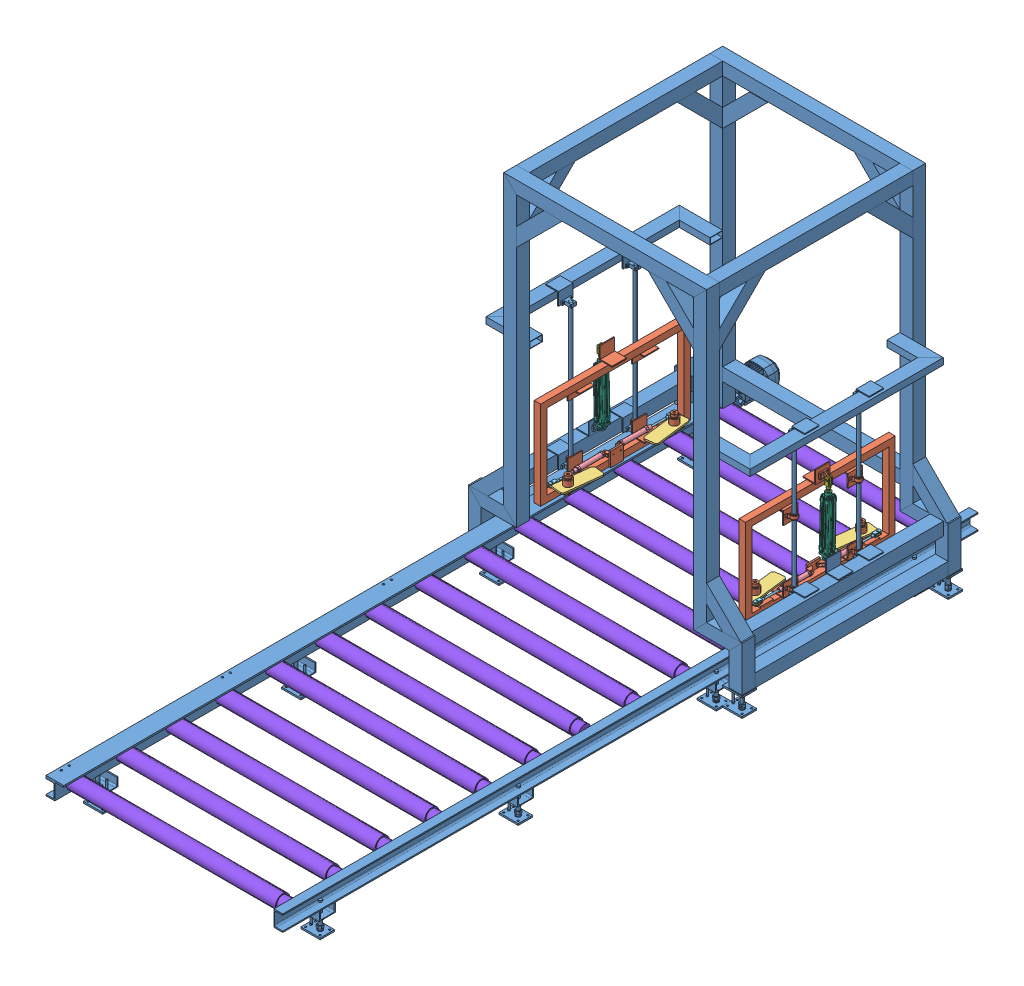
SolidWorks assembly unstackerv2.SLDASM, configuration Défaut (file format 7000). Lengths in mm.
Overall size (1762 2191 4544.5).
33 component instances, 8 part files, 70 mates.
Components (placement in the parent):
- ensemble-fixe-1: ensemble-fixe.SLDPRT [Défaut] at origin size (1762 2191 4544.5)
- systeme support de doigt-1: systeme support de doigt.SLDPRT [Défaut] at (-615.8 538.0756 308.5297) x (0 0 1) z (-1 0 0) size (930 630 168)
- CHA_7-Doigt-1: CHA_7-Doigt.SLDPRT [Défaut] at (-653.1156 597.1756 386.7807) x (0.119743 0 0.992805) z (0 1 0) size (240 105 10)
- CHA_7-Corp verin D25-1: CHA_7-Corp verin D25.sldprt [Défaut] at (-638.4662 602.1756 553.6131) x (-0.01326 0 0.999912) z (0 -1 0) size (207 27 27)
- ensemble tige verin D25-1: ensemble tige verin D25.SLDPRT [Défaut] at (-632.4635 595.1107 724.7077) x (-0.867076 0.498043 -0.011499) z (0.01326 0 -0.999912) size (27.3 29.26 240.78)
- CHA_7-Corp verin D25-2: CHA_7-Corp verin D25.sldprt [Défaut] at (-638.4662 602.1756 993.4463) x (-0.01326 0 -0.999912) z (0 -1 0) size (207 27 27)
- CHA_7-Doigt-2: CHA_7-Doigt.SLDPRT [Défaut] at (-653.1156 607.1756 1160.2788) x (0.119743 0 -0.992805) z (0 -1 0) size (240 105 10)
- ensemble tige verin D25-2: ensemble tige verin D25.SLDPRT [Défaut] at (-649.0039 595.1107 822.5711) x (0.867076 0.498043 -0.011499) z (0.01326 0 0.999912) size (27.3 29.26 240.78)
- systeme support de doigt-2: systeme support de doigt.SLDPRT [Défaut] at (615.8 538.0756 1238.2229) x (0 0 -1) z (1 0 0) size (930 630 168)
- CHA_7-Corp verin D25-3: CHA_7-Corp verin D25.sldprt [Défaut] at (638.4662 602.1756 553.3062) x (0.01326 0 0.999912) z (0 -1 0) size (207 27 27)
- CHA_7-Doigt-3: CHA_7-Doigt.SLDPRT [Défaut] at (653.1156 607.1756 386.4738) x (-0.119743 0 0.992805) z (0 -1 0) size (240 105 10)
- ensemble tige verin D25-3: ensemble tige verin D25.SLDPRT [Défaut] at (649.0039 595.1107 724.1815) x (-0.867076 0.498043 0.011499) z (-0.01326 0 -0.999912) size (27.3 29.26 240.78)
- CHA_7-Corp verin D25-4: CHA_7-Corp verin D25.sldprt [Défaut] at (638.4662 602.1756 993.1395) x (0.01326 0 -0.999912) z (0 -1 0) size (207 27 27)
- CHA_7-Doigt-4: CHA_7-Doigt.SLDPRT [Défaut] at (653.1156 597.1756 1159.9719) x (-0.119743 0 -0.992805) z (0 1 0) size (240 105 10)
- ensemble tige verin D25-4: ensemble tige verin D25.SLDPRT [Défaut] at (632.4635 595.1107 822.0448) x (0.867076 0.498043 0.011499) z (-0.01326 0 0.999912) size (27.3 29.26 240.78)
- corp verin D40-1: corp verin D40.SLDPRT [Défaut] at (-750.0686 879.3027 1100.6768) x (0 0 1) z (-0.023417 0.999726 0) size (53 53 367.5)
- tige Verin D40-2: tige Verin D40.SLDPRT [Défaut] at (-690.863 677.3225 775.2118) x (0 0 -1) z (-0.023417 0.999726 0) size (40 40 370)
- corp verin D40-2: corp verin D40.SLDPRT [Défaut] at (750.0686 879.3027 446.0826) x (0 0 -1) z (0.023417 0.999726 0) size (53 53 367.5)
- tige Verin D40-3: tige Verin D40.SLDPRT [Défaut] at (690.863 677.3225 771.5476) x (0 0 1) z (0.023417 0.999726 0) size (40 40 370)
- CHA_7rouleau commande-2: CHA_7rouleau commande.SLDPRT [Défaut] at (-672.5 448.1904 58.3797) x (1 0 0) z (0 -0.985836 0.16771) size (1360 89 89)
- CHA_7rouleau commande-3: CHA_7rouleau commande.SLDPRT [Défaut] at (-680 448.1904 367.3797) x (1 0 0) z (0 0.898544 -0.438884) size (1360 89 89)
- CHA_7rouleau commande-4: CHA_7rouleau commande.SLDPRT [Défaut] at (-680 448.1904 676.3797) x (1 0 0) z (0 0.88032 -0.47438) size (1360 89 89)
- CHA_7rouleau commande-5: CHA_7rouleau commande.SLDPRT [Défaut] at (-680 448.1904 985.3797) x (1 0 0) z (0 0.819392 -0.573233) size (1360 89 89)
- CHA_7rouleau commande-7: CHA_7rouleau commande.SLDPRT [Défaut] at (-680 448.1904 1603.3797) x (1 0 0) z (0 0.986009 -0.166691) size (1360 89 89)
- CHA_7rouleau commande-8: CHA_7rouleau commande.SLDPRT [Défaut] at (-680 448.1904 1912.3797) x (1 0 0) z (0 0.956459 -0.291868) size (1360 89 89)
- CHA_7rouleau commande-9: CHA_7rouleau commande.SLDPRT [Défaut] at (-711.5119 448.1904 2221.3797) x (1 0 0) z (0 0.631126 0.775681) size (1360 89 89)
- CHA_7rouleau commande-10: CHA_7rouleau commande.SLDPRT [Défaut] at (-680 448.1904 2530.3797) x (1 0 0) z (0 0.656428 -0.754388) size (1360 89 89)
- CHA_7rouleau commande-11: CHA_7rouleau commande.SLDPRT [Défaut] at (-680 448.1904 2839.3797) x (1 0 0) z (0 0.698585 -0.715527) size (1360 89 89)
- CHA_7rouleau commande-12: CHA_7rouleau commande.SLDPRT [Défaut] at (-680 448.1904 3148.3797) x (1 0 0) z (0 0.828178 -0.560465) size (1360 89 89)
- CHA_7rouleau commande-13: CHA_7rouleau commande.SLDPRT [Défaut] at (-680 448.1904 3457.3797) x (1 0 0) z (0 0.997224 -0.074457) size (1360 89 89)
- CHA_7rouleau commande-14: CHA_7rouleau commande.SLDPRT [Défaut] at (-680 448.1904 3766.3797) x (1 0 0) z (0 0.577241 -0.816574) size (1360 89 89)
- CHA_7rouleau commande-15: CHA_7rouleau commande.SLDPRT [Défaut] at (-680 448.1904 4075.3797) x (1 0 0) z (0 0.981161 0.193194) size (1360 89 89)
- CHA_7rouleau commande-16: CHA_7rouleau commande.SLDPRT [Défaut] at (-680 448.1904 1294.3797) x (1 0 0) z (0 0.969586 0.244749) size (1360 89 89)
Mates (geometry in assembly coordinates):
- Coaxiale4: concentric anti-aligned: cylinder of ensemble-fixe-1 through (-694 1469.6904 573.3797) axis (0 -1 0) radius 10; cylinder of systeme support de doigt-1 through (-694 995.3756 573.3797) axis (0 1 0) radius 10
- Coaxiale5: concentric anti-aligned: cylinder of ensemble-fixe-1 through (-694 1469.6904 973.3797) axis (0 -1 0) radius 10; cylinder of systeme support de doigt-1 through (-694 995.3756 973.3797) axis (0 1 0) radius 10
- Coaxiale7: concentric aligned: cylinder of systeme support de doigt-1 through (-580.8 642.1756 443.5297) axis (0 -1 0) radius 25; cylinder of CHA_7-Doigt-1 through (-580.8 607.1756 443.5297) axis (0 -1 0) radius 25
- Distance4: distance = 35 mm aligned: plane of CHA_7-Doigt-1 through (-649.5233 607.1756 416.5648) normal (0 1 0); plane of systeme support de doigt-1 through (-580.8 642.1756 443.5297) normal (0 1 0)
- Coaxiale8: concentric anti-aligned: cylinder of systeme support de doigt-1 through (-640.8 593.3256 729.5976) axis (0 1 0) radius 4; cylinder of CHA_7-Corp verin D25-1 through (-640.8 610.1256 729.5976) axis (0 -1 0) radius 4
- Coaxiale9: concentric aligned: cylinder of CHA_7-Doigt-1 through (-636.4274 607.1756 399.8766) axis (0 -1 0) radius 5.5; cylinder of ensemble tige verin D25-1 through (-636.4274 607.1756 399.8766) axis (0 -1 0) radius 5
- Coïncidente5: coincident anti-aligned: plane of CHA_7-Doigt-1 through (-649.5233 607.1756 416.5648) normal (0 1 0); plane of ensemble tige verin D25-1 through (-646.1843 607.1756 381.484) normal (0 -1 0)
- Coaxiale10: concentric aligned: cylinder of CHA_7-Corp verin D25-1 through (-638.6651 602.1756 568.6118) axis (-0.01326 0 0.999912) radius 13.25; cylinder of ensemble tige verin D25-1 through (-638.864 602.1756 583.6104) axis (-0.01326 0 0.999912) radius 12.5
- DistanceLimite1: limit distance = 95 mm aligned: plane of ensemble tige verin D25-1 through (-656.6493 597.5064 622.378) normal (-0.01326 0 0.999912); plane of CHA_7-Corp verin D25-1 through (-628.3701 615.6756 717.7614) normal (-0.01326 0 0.999912)
- Coaxiale11: concentric aligned: cylinder of systeme support de doigt-1 through (-640.8 609.8256 817.4618) axis (0 -1 0) radius 4; cylinder of CHA_7-Corp verin D25-2 through (-640.8 610.1256 817.4618) axis (0 -1 0) radius 4
- Coaxiale12: concentric anti-aligned: cylinder of systeme support de doigt-1 through (-580.8 642.1756 1103.5297) axis (0 -1 0) radius 25; cylinder of CHA_7-Doigt-2 through (-580.8 597.1756 1103.5297) axis (0 1 0) radius 25
- Distance6: distance = 35 mm aligned: plane of CHA_7-Doigt-2 through (-649.5233 607.1756 1130.4946) normal (0 1 0); plane of systeme support de doigt-1 through (-580.8 642.1756 1103.5297) normal (0 1 0)
- Coaxiale13: concentric anti-aligned: cylinder of CHA_7-Doigt-2 through (-636.4274 597.1756 1147.1828) axis (0 1 0) radius 5.5; cylinder of ensemble tige verin D25-2 through (-636.4274 607.1756 1147.1828) axis (0 -1 0) radius 5
- Coïncidente10: coincident anti-aligned: plane of CHA_7-Doigt-2 through (-649.5233 607.1756 1130.4946) normal (0 1 0); plane of ensemble tige verin D25-2 through (-626.1861 607.1756 1165.3102) normal (0 -1 0)
- Coaxiale14: concentric aligned: cylinder of CHA_7-Corp verin D25-2 through (-638.6651 602.1756 978.4477) axis (-0.01326 0 -0.999912) radius 13.25; cylinder of ensemble tige verin D25-2 through (-638.864 602.1756 963.449) axis (-0.01326 0 -0.999912) radius 12.5
- DistanceLimite2: limit distance = 95 mm aligned: plane of ensemble tige verin D25-2 through (-622.1129 597.5064 924.2234) normal (-0.01326 0 -0.999912); plane of CHA_7-Corp verin D25-2 through (-652.9116 615.6756 829.6235) normal (-0.01326 0 -0.999912)
- Coaxiale15: concentric anti-aligned: cylinder of ensemble-fixe-1 through (694 1469.6904 973.3729) axis (0 -1 0) radius 10; cylinder of systeme support de doigt-2 through (694 995.3756 973.3729) axis (0 1 0) radius 10
- Coaxiale16: concentric anti-aligned: cylinder of ensemble-fixe-1 through (694 1469.6904 573.3729) axis (0 -1 0) radius 10; cylinder of systeme support de doigt-2 through (694 995.3756 573.3729) axis (0 1 0) radius 10
- Coaxiale17: concentric anti-aligned: cylinder of systeme support de doigt-2 through (580.8 642.1756 443.2229) axis (0 -1 0) radius 25; cylinder of CHA_7-Doigt-3 through (580.8 597.1756 443.2229) axis (0 1 0) radius 25
- Distance8: distance = 35 mm aligned: plane of CHA_7-Doigt-3 through (649.5233 607.1756 416.258) normal (0 1 0); plane of systeme support de doigt-2 through (580.8 642.1756 443.2229) normal (0 1 0)
- Coaxiale18: concentric aligned: cylinder of systeme support de doigt-2 through (640.8 609.8256 729.2907) axis (0 -1 0) radius 4; cylinder of CHA_7-Corp verin D25-3 through (640.8 610.1256 729.2907) axis (0 -1 0) radius 4
- Coaxiale19: concentric anti-aligned: cylinder of CHA_7-Doigt-3 through (636.4274 597.1756 399.5697) axis (0 1 0) radius 5.5; cylinder of ensemble tige verin D25-3 through (636.4274 607.1756 399.5697) axis (0 -1 0) radius 5
- Coaxiale20: concentric aligned: cylinder of CHA_7-Corp verin D25-3 through (638.6651 602.1756 568.3049) axis (0.01326 0 0.999912) radius 13.25; cylinder of ensemble tige verin D25-3 through (638.864 602.1756 583.3036) axis (0.01326 0 0.999912) radius 12.5
- DistanceLimite3: limit distance = 95 mm aligned: plane of ensemble tige verin D25-3 through (622.1129 597.5064 622.5292) normal (0.01326 0 0.999912); plane of CHA_7-Corp verin D25-3 through (652.9116 615.6756 717.1291) normal (0.01326 0 0.999912)
- Coïncidente14: coincident anti-aligned: plane of CHA_7-Doigt-3 through (649.5233 607.1756 416.258) normal (0 1 0); plane of ensemble tige verin D25-3 through (626.1861 607.1756 381.4424) normal (0 -1 0)
- Coaxiale21: concentric aligned: cylinder of systeme support de doigt-2 through (580.8 642.1756 1103.2229) axis (0 -1 0) radius 25; cylinder of CHA_7-Doigt-4 through (580.8 607.1756 1103.2229) axis (0 -1 0) radius 25
- Coaxiale22: concentric anti-aligned: cylinder of systeme support de doigt-2 through (640.8 593.3256 817.155) axis (0 1 0) radius 4; cylinder of CHA_7-Corp verin D25-4 through (640.8 610.1256 817.155) axis (0 -1 0) radius 4
- Distance10: distance = 35 mm aligned: plane of CHA_7-Doigt-4 through (649.5233 607.1756 1130.1878) normal (0 1 0); plane of systeme support de doigt-2 through (580.8 642.1756 1103.2229) normal (0 1 0)
- Coaxiale23: concentric aligned: cylinder of CHA_7-Doigt-4 through (636.4274 607.1756 1146.876) axis (0 -1 0) radius 5.5; cylinder of ensemble tige verin D25-4 through (636.4274 607.1756 1146.876) axis (0 -1 0) radius 5
- Coaxiale24: concentric aligned: cylinder of CHA_7-Corp verin D25-4 through (638.6651 602.1756 978.1408) axis (0.01326 0 -0.999912) radius 13.25; cylinder of ensemble tige verin D25-4 through (638.864 602.1756 963.1421) axis (0.01326 0 -0.999912) radius 12.5
- Coïncidente17: coincident anti-aligned: plane of CHA_7-Doigt-4 through (649.5233 607.1756 1130.1878) normal (0 1 0); plane of ensemble tige verin D25-4 through (646.1843 607.1756 1165.2685) normal (0 -1 0)
- DistanceLimite4: limit distance = 95 mm aligned: plane of ensemble tige verin D25-4 through (656.6493 597.5064 924.3746) normal (0.01326 0 -0.999912); plane of CHA_7-Corp verin D25-4 through (628.3701 615.6756 828.9912) normal (0.01326 0 -0.999912)
- Coaxiale25: concentric anti-aligned: cylinder of ensemble-fixe-1 through (-698 694.1904 746.3797) axis (0 0 1) radius 6; cylinder of corp verin D40-1 through (-698 694.1904 795.8797) axis (0 0 -1) radius 6
- Coïncidente18: coincident anti-aligned: plane of ensemble-fixe-1 through (-680 663.6903 765.3797) normal (0 0 -1); plane of corp verin D40-1 through (-698 694.1904 765.3797) normal (0 0 1)
- Coaxiale26: concentric anti-aligned: cylinder of systeme support de doigt-1 through (-707.8 1112.5756 778.0297) axis (0 0 -1) radius 6; cylinder of tige Verin D40-2 through (-707.8 1112.5756 757.3797) axis (0 0 1) radius 6
- Coaxiale29: concentric anti-aligned: cone of corp verin D40-1 through (-705.9501 1033.5973 773.3797) axis (-0.023417 0.999726 0); cylinder of tige Verin D40-2 through (-698.853 730.6071 773.3797) axis (0.023417 -0.999726 0) radius 20
- DistanceLimite5: limit distance = 10 mm aligned: plane of tige Verin D40-2 through (-699.5806 761.6719 773.3797) normal (0.023417 -0.999726 0); plane of corp verin D40-1 through (-718.3413 751.2297 768.0547) normal (0.023417 -0.999726 0)
- Coaxiale30: concentric anti-aligned: cylinder of ensemble-fixe-1 through (698 694.1904 800.3797) axis (0 0 -1) radius 6; cylinder of corp verin D40-2 through (698 694.1904 750.8797) axis (0 0 1) radius 6
- Coïncidente19: coincident anti-aligned: plane of ensemble-fixe-1 through (680 663.6903 781.3797) normal (0 0 1); plane of corp verin D40-2 through (698 694.1904 781.3797) normal (0 0 -1)
- Coaxiale31: concentric anti-aligned: cylinder of systeme support de doigt-2 through (707.8 1112.5756 768.7229) axis (0 0 1) radius 6; cylinder of tige Verin D40-3 through (707.8 1112.5756 789.3797) axis (0 0 -1) radius 6
- Coaxiale33: concentric anti-aligned: cone of corp verin D40-2 through (705.9501 1033.5973 773.3797) axis (0.023417 0.999726 0); cylinder of tige Verin D40-3 through (698.853 730.6071 773.3797) axis (-0.023417 -0.999726 0) radius 20
- DistanceLimite6: limit distance = 10 mm aligned: plane of tige Verin D40-3 through (699.5806 761.6719 773.3797) normal (-0.023417 -0.999726 0); plane of corp verin D40-2 through (718.3413 751.2297 778.7047) normal (-0.023417 -0.999726 0)
- Coaxiale35: concentric aligned: circle of ensemble-fixe-1; cylinder of CHA_7rouleau commande-2 through (654.5 448.1904 58.3797) axis (1 0 0) radius 6
- Coïncidente22: coincident anti-aligned: plane of ensemble-fixe-1 through (680 398.1904 -126.6203) normal (-1 0 0); plane of CHA_7rouleau commande-2 through (680 448.1904 58.3797) normal (1 0 0)
- Coïncidente23: coincident anti-aligned: plane of ensemble-fixe-1 through (-680 398.1904 4190.3797) normal (1 0 0); plane of CHA_7rouleau commande-3 through (-680 448.1904 367.3797) normal (-1 0 0)
- Coaxiale36: concentric aligned: cylinder of ensemble-fixe-1 through (-680 448.1904 367.3797) axis (-1 0 0) radius 7.5; cylinder of CHA_7rouleau commande-3 through (-653 448.1904 367.3797) axis (-1 0 0) radius 5
- Coïncidente24: coincident anti-aligned: plane of ensemble-fixe-1 through (-680 398.1904 4190.3797) normal (1 0 0); plane of CHA_7rouleau commande-5 through (-680 448.1904 985.3797) normal (-1 0 0)
- Coïncidente26: coincident anti-aligned: plane of ensemble-fixe-1 through (-680 398.1904 4190.3797) normal (1 0 0); plane of CHA_7rouleau commande-7 through (-680 448.1904 1603.3797) normal (-1 0 0)
- Coïncidente27: coincident anti-aligned: plane of ensemble-fixe-1 through (-680 398.1904 4190.3797) normal (1 0 0); plane of CHA_7rouleau commande-8 through (-680 448.1904 1912.3797) normal (-1 0 0)
- Coïncidente28: coincident anti-aligned: plane of ensemble-fixe-1 through (-680 398.1904 4190.3797) normal (1 0 0); plane of CHA_7rouleau commande-10 through (-680 448.1904 2530.3797) normal (-1 0 0)
- Coïncidente29: coincident anti-aligned: plane of ensemble-fixe-1 through (-680 398.1904 4190.3797) normal (1 0 0); plane of CHA_7rouleau commande-11 through (-680 448.1904 2839.3797) normal (-1 0 0)
- Coïncidente30: coincident anti-aligned: plane of ensemble-fixe-1 through (-680 398.1904 4190.3797) normal (1 0 0); plane of CHA_7rouleau commande-12 through (-680 448.1904 3148.3797) normal (-1 0 0)
- Coïncidente31: coincident anti-aligned: plane of ensemble-fixe-1 through (-680 398.1904 4190.3797) normal (1 0 0); plane of CHA_7rouleau commande-13 through (-680 448.1904 3457.3797) normal (-1 0 0)
- Coïncidente32: coincident anti-aligned: plane of ensemble-fixe-1 through (-680 398.1904 4190.3797) normal (1 0 0); plane of CHA_7rouleau commande-14 through (-680 448.1904 3766.3797) normal (-1 0 0)
- Coïncidente33: coincident anti-aligned: plane of ensemble-fixe-1 through (-680 398.1904 4190.3797) normal (1 0 0); plane of CHA_7rouleau commande-15 through (-680 448.1904 4075.3797) normal (-1 0 0)
- Coaxiale37: concentric aligned: cylinder of ensemble-fixe-1 through (-680 448.1904 985.3797) axis (-1 0 0) radius 7.5; cylinder of CHA_7rouleau commande-5 through (-653 448.1904 985.3797) axis (-1 0 0) radius 5
- Coaxiale38: concentric aligned: circle of ensemble-fixe-1; cylinder of CHA_7rouleau commande-16 through (-653 448.1904 1294.3797) axis (-1 0 0) radius 5
- Coïncidente35: coincident anti-aligned: plane of ensemble-fixe-1 through (-680 398.1904 4190.3797) normal (1 0 0); plane of CHA_7rouleau commande-16 through (-680 448.1904 1294.3797) normal (-1 0 0)
- Coaxiale39: concentric aligned: circle of ensemble-fixe-1; cylinder of CHA_7rouleau commande-7 through (-653 448.1904 1603.3797) axis (-1 0 0) radius 5
- Coaxiale40: concentric aligned: circle of ensemble-fixe-1; cylinder of CHA_7rouleau commande-8 through (-653 448.1904 1912.3797) axis (-1 0 0) radius 5
- Coaxiale41: concentric aligned: circle of ensemble-fixe-1; cylinder of CHA_7rouleau commande-9 through (-684.5119 448.1904 2221.3797) axis (-1 0 0) radius 5
- Coaxiale42: concentric aligned: circle of ensemble-fixe-1; cylinder of CHA_7rouleau commande-10 through (-653 448.1904 2530.3797) axis (-1 0 0) radius 5
- Coaxiale43: concentric aligned: circle of ensemble-fixe-1; cylinder of CHA_7rouleau commande-11 through (-653 448.1904 2839.3797) axis (-1 0 0) radius 5
- Coaxiale44: concentric aligned: circle of ensemble-fixe-1; cylinder of CHA_7rouleau commande-12 through (-653 448.1904 3148.3797) axis (-1 0 0) radius 5
- Coaxiale45: concentric aligned: circle of ensemble-fixe-1; cylinder of CHA_7rouleau commande-13 through (-653 448.1904 3457.3797) axis (-1 0 0) radius 5
- Coaxiale46: concentric aligned: circle of ensemble-fixe-1; cylinder of CHA_7rouleau commande-14 through (-653 448.1904 3766.3797) axis (-1 0 0) radius 5
- Coaxiale47: concentric aligned: circle of ensemble-fixe-1; cylinder of CHA_7rouleau commande-15 through (-653 448.1904 4075.3797) axis (-1 0 0) radius 5
- Coïncidente36: coincident anti-aligned: plane of ensemble-fixe-1 through (-680 398.1904 4190.3797) normal (1 0 0); plane of CHA_7rouleau commande-4 through (-680 448.1904 676.3797) normal (-1 0 0)
- Coaxiale48: concentric aligned: circle of ensemble-fixe-1; cylinder of CHA_7rouleau commande-4 through (-653 448.1904 676.3797) axis (-1 0 0) radius 5
- Verrouiller1: lock: unknown of ensemble-fixe-1; unknown of CHA_7rouleau commande-9
